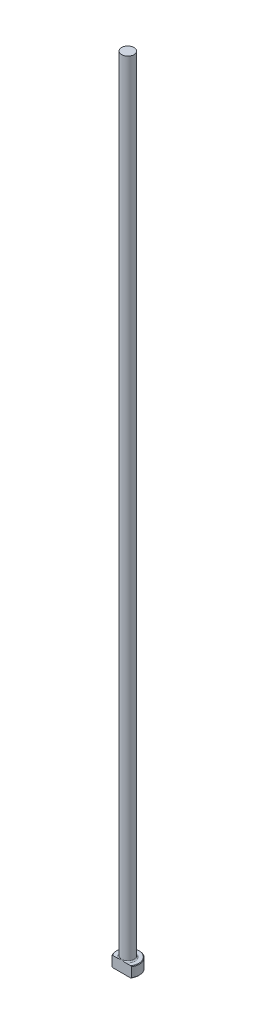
from build123d import *

# Parameters (mm, degrees)
CHAMFER1_SIZE = 0.254
FILLET1_R     = 0.508
KEY_DEPTH     = 356.674757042


with BuildPart() as part:
    # Sketch1 → Revolve1 (revolve)
    with BuildSketch(Plane.XY, mode=Mode.PRIVATE) as revolve1_sk:
        Polygon((0, 0), (-5.1562, 0), (-5.1562, 4.7498), (-2.77749, 4.7498), (-2.77749, 355.6), (0, 355.6), align=None)
    revolve(revolve1_sk.sketch.rotate(Axis((0, 259.958771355, 0), (0, -1, 0)), 270), axis=Axis((0, 259.958771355, 0), (0, -1, 0)))

    # Chamfer1
    chamfer1_edges = [part.edges().sort_by_distance(p)[0] for p in [
        (0, 4.7498, -5.1562),
        (0, 0, -5.1562),
    ]]
    chamfer(chamfer1_edges, length=CHAMFER1_SIZE)

    # Fillet1
    fillet1_edges = [part.edges().sort_by_distance(p)[0] for p in [
        (0, 4.7498, -2.77749),
    ]]
    fillet(fillet1_edges, radius=FILLET1_R)

    # Sketch2 → Key (cut, through all)
    with BuildSketch(Plane(origin=(0, 0, 0), x_dir=(1, 0, 0), z_dir=(0, 1, 0))):
        with BuildLine():
            Line((-4.344185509, -2.77749), (4.344185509, -2.77749))
            ThreePointArc((4.344185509, -2.77749), (0, -5.1562), (-4.344185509, -2.77749))
        make_face()
    extrude(amount=KEY_DEPTH, mode=Mode.SUBTRACT)


solid = part.part
